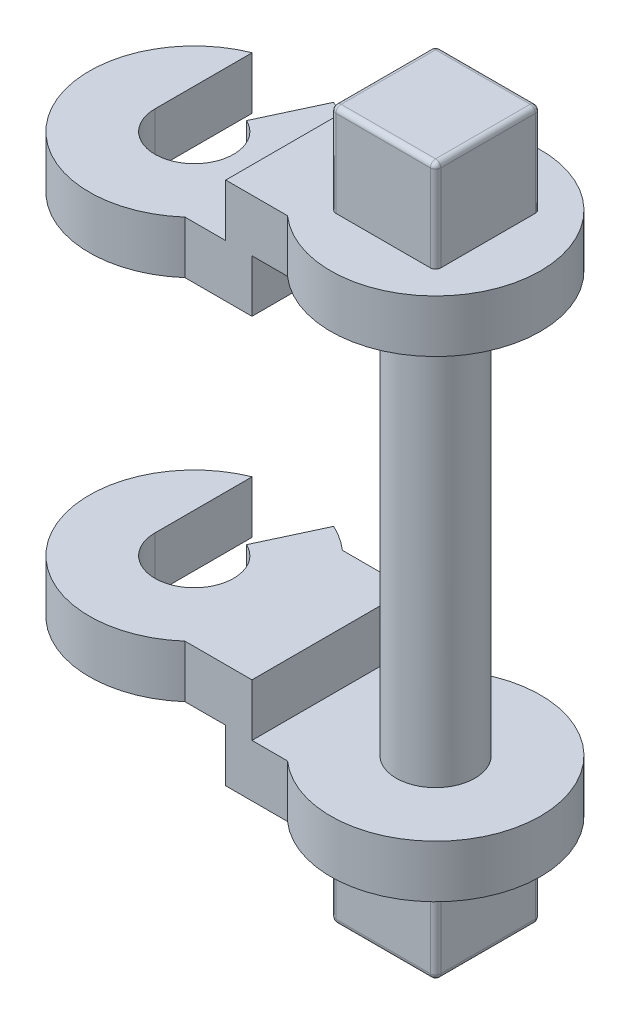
from build123d import *

# Parameters (mm, degrees)
EXTRUDE_1_DEPTH      = 4
EXTRUDE_1_DEPTH_BACK = 4
SKETCH_1_R           = 0.75
SKETCH_2_R           = 2
EXTRUDE_2_DEPTH      = 1
EXTRUDE_START        = 1
SKETCH_3_R           = 2
EXTRUDE_3_DEPTH      = 1
SKETCH_4_W           = 2
SKETCH_4_H           = 2
EXTRUDE_4_DEPTH      = 1.75
SKETCH_5_W           = 2
SKETCH_5_H           = 2
EXTRUDE_5_DEPTH      = 1.75
SKETCH_6_W           = 1.5
SKETCH_6_H           = 3
EXTRUDE_6_DEPTH      = 1
SKETCH_7_W           = 1.5
SKETCH_7_H           = 3
EXTRUDE_8_DEPTH      = 1
SKETCH_8_W           = 3
SKETCH_8_H           = 2
EXTRUDE_9_DEPTH      = 0.5
EXTRUDE_10_DEPTH     = 1
EXTRUDE_START_2      = 7
EXTRUDE_11_DEPTH     = 1
CUT_EXTRUDE_1_DEPTH  = 13.771941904
FILLET_1_R           = 0.1


with BuildPart() as part:
    # Sketch 1 → Extrude 1 (new, two sides: drawn at the far end of the back side and taken through both)
    with BuildSketch(Plane(origin=(0, 0, 0), x_dir=(1, 0, 0), z_dir=(0, 1, 0)).offset(-EXTRUDE_1_DEPTH_BACK)):
        with Locations(Location((0, 0, 0), (0, 0, 270))):
            Circle(SKETCH_1_R)
    extrude(amount=EXTRUDE_1_DEPTH + EXTRUDE_1_DEPTH_BACK)

    # Sketch 2 → Extrude 2 (add)
    with BuildSketch(Plane(origin=(0, 4, 0), x_dir=(-1, 0, 0), z_dir=(0, 1, 0))):
        with Locations(Location((0, 0, 0), (0, 0, 90))):
            Circle(SKETCH_2_R)
    extrude(amount=EXTRUDE_2_DEPTH)

    # Sketch 3 → Extrude 3 (add)
    with BuildSketch(Plane.XZ.offset(4).offset(EXTRUDE_START)):
        with Locations(Location((0, 0, 0), (0, 0, 90))):
            Circle(SKETCH_3_R)
    extrude(amount=-EXTRUDE_3_DEPTH)

    # Sketch 4 → Extrude 4 (add)
    with BuildSketch(Plane(origin=(0, 5, 0), x_dir=(-1, 0, 0), z_dir=(0, 1, 0))):
        Rectangle(SKETCH_4_W, SKETCH_4_H)
    extrude(amount=EXTRUDE_4_DEPTH)

    # Sketch 5 → Extrude 5 (add)
    with BuildSketch(Plane.XZ.offset(5)):
        Rectangle(SKETCH_5_W, SKETCH_5_H)
    extrude(amount=EXTRUDE_5_DEPTH)

    # Sketch 6 → Extrude 6 (add)
    with BuildSketch(Plane(origin=(0, 5, 0), x_dir=(-1, 0, 0), z_dir=(0, 1, 0))):
        with Locations((1.75, 0)):
            Rectangle(SKETCH_6_W, SKETCH_6_H)
    extrude(amount=-EXTRUDE_6_DEPTH)

    # Sketch 7 → Extrude 8 (add)
    with BuildSketch(Plane.XZ.offset(5)):
        with Locations((-1.75, 0)):
            Rectangle(SKETCH_7_W, SKETCH_7_H)
    extrude(amount=-EXTRUDE_8_DEPTH)

    # Sketch 8 → Extrude 9 (add)
    with BuildSketch(Plane.ZY.offset(2.5)):
        with Locations((0, 4)):
            Rectangle(SKETCH_8_W, SKETCH_8_H)
        with Locations((0, -4)):
            Rectangle(SKETCH_8_W, SKETCH_8_H)
    extrude(amount=-EXTRUDE_9_DEPTH)

    # Sketch 9 → Extrude 10 (add)
    with BuildSketch(Plane.XZ.offset(-3)):
        with BuildLine():
            Line((-2.5, -1.5), (-3.277124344, -1.5))
            ThreePointArc((-3.277124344, -1.5), (-6.6, 0), (-3.277124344, 1.5))
            Line((-3.277124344, 1.5), (-2.5, 1.5))
            Line((-2.5, 1.5), (-2.5, -1.5))
        make_face()
    extrude(amount=-EXTRUDE_10_DEPTH)

    # Sketch 9_2 → Extrude 11 (add)
    with BuildSketch(Plane.XZ.offset(-3).offset(EXTRUDE_START_2)):
        with BuildLine():
            Line((-2.5, -1.5), (-3.277124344, -1.5))
            ThreePointArc((-3.277124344, -1.5), (-6.6, 0), (-3.277124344, 1.5))
            Line((-3.277124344, 1.5), (-2.5, 1.5))
            Line((-2.5, 1.5), (-2.5, -1.5))
        make_face()
    extrude(amount=-EXTRUDE_11_DEPTH)

    # Sketch 10 → Cut-Extrude 1 (cut, through all)
    with BuildSketch(Plane(origin=(0, 4, 0), x_dir=(-1, 0, 0), z_dir=(0, 1, 0))):
        with BuildLine():
            Line((5.35, 0), (5.35, -1.854049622))
            ThreePointArc((5.35, -1.854049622), (4.548070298, -1.999325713), (3.754763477, -1.812615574))
            Line((3.754763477, -1.812615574), (4.283036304, -0.67973084))
            ThreePointArc((4.283036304, -0.67973084), (4.197025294, 0.632543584), (5.35, 0))
        make_face()
    extrude(amount=-CUT_EXTRUDE_1_DEPTH, mode=Mode.SUBTRACT)

    # Fillet 1
    fillet_1_edges = [part.edges().sort_by_distance(p)[0] for p in [
        (1, 5.875, 1),
        (1, 5.875, -1),
        (-1, 5.875, -1),
        (-1, 5.875, 1),
        (1, 6.75, 0),
        (0, 6.75, -1),
        (-1, 6.75, 0),
        (0, 6.75, 1),
        (-1, -5.875, 1),
        (-1, -5.875, -1),
        (1, -5.875, -1),
        (1, -5.875, 1),
        (-1, -6.75, 0),
        (0, -6.75, -1),
        (1, -6.75, 0),
        (0, -6.75, 1),
    ]]
    fillet(fillet_1_edges, radius=FILLET_1_R)


solid = part.part
